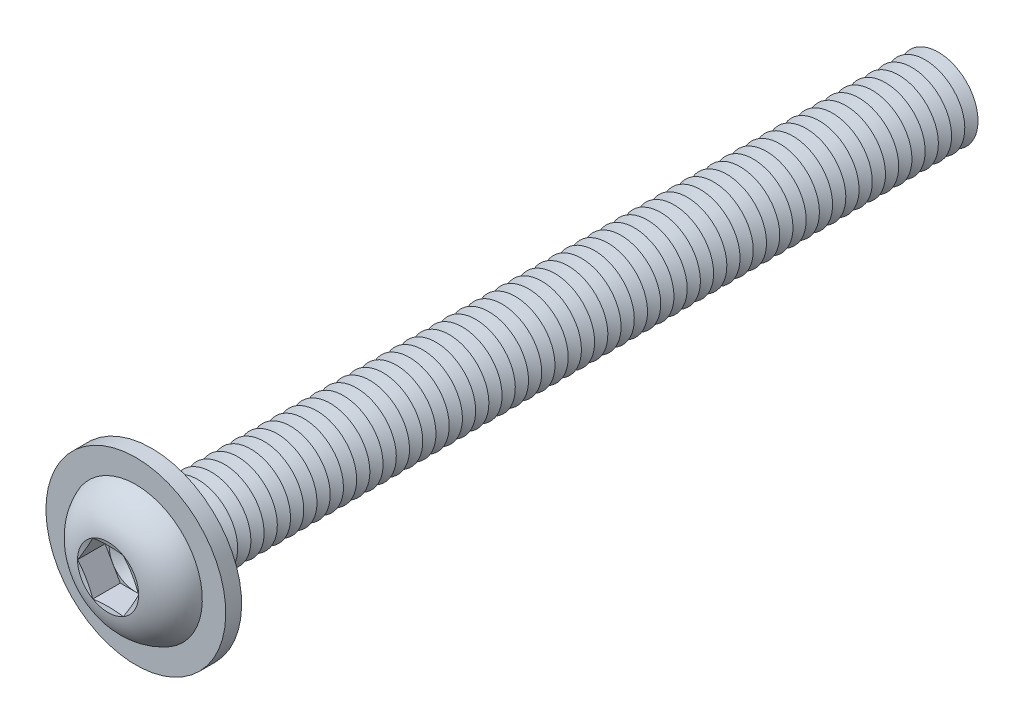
from build123d import *

# Parameters (mm, degrees)
FILLET1_R           = 0.5
LPATTERN1_COUNT     = 60
LPATTERN1_PITCH     = 1
CUT_EXTRUDE1_DEPTH  = 2.08
SKETCH5_R           = 6.8
SKETCH5_R_2         = 3.5
BOSS_EXTRUDE1_DEPTH = 1.2


with BuildPart() as part:
    # Sketch1 → Revolve1 (revolve)
    with BuildSketch(Plane(origin=(0, 0, 0), x_dir=(0, 0, -1), z_dir=(1, 0, 0))):
        with BuildLine():
            Line((0, 3), (0, 5.25))
            ThreePointArc((0, 5.25), (-2.210041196, 4.408189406), (-3.3, 2.3094))
            Line((-3.3, 2.3094), (-2.990599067, 1.1547))
            Line((-2.990599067, 1.1547), (-3.3, 1.1547))
            Line((-3.3, 1.1547), (-3.3, 0))
            Line((-3.3, 0), (60, 0))
            Line((60, 0), (60, 3))
            Line((60, 3), (0, 3))
        make_face()
    revolve(axis=Axis((0, 0, -60), (0, 0, 1)))

    # Fillet1
    fillet1_edges = [part.edges().sort_by_distance(p)[0] for p in [
        (0, -3, 0),
    ]]
    fillet(fillet1_edges, radius=FILLET1_R)

    # Sketch2 → Cut-Revolve1 (revolve, cut)
    with BuildSketch(Plane(origin=(0, 0, 0), x_dir=(0, 0, -1), z_dir=(1, 0, 0))):
        Polygon((59.5, 3), (60.5, 3), (60, 2.133974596), align=None)
    cut_revolve1 = revolve(axis=Axis((0, 0, -60), (0, 0, -1)), mode=Mode.SUBTRACT)

    # LPattern1: Cut-Revolve1 ×60
    with Locations(*[(0, 0, i * LPATTERN1_PITCH) for i in range(1, LPATTERN1_COUNT)]):
        add(cut_revolve1, mode=Mode.SUBTRACT)

    # Sketch3 → Cut-Extrude1 (cut)
    with BuildSketch(Plane.XY.offset(3.3)):
        Polygon((1.1547, 1.999999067), (-1.1547, 1.999999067), (-2.3094, 0), (-1.1547, -1.999999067), (1.1547, -1.999999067), (2.3094, 0), align=None)
    extrude(amount=-CUT_EXTRUDE1_DEPTH, mode=Mode.SUBTRACT)

    # Cut-Extrude2 cone 1 section (on through the dimple's axis) → Cut-Extrude2 (revolve, cut)
    with BuildSketch(Plane(origin=(0, 0, 1.22), x_dir=(0, -1, 0), z_dir=(1, 0, 0))):
        Polygon((0, 0), (1.999999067, 0), (0, 1.1547), align=None)
    revolve(axis=Axis((0, 0, 1.22), (0, 0, -1)), mode=Mode.SUBTRACT)

    # Sketch5 → Boss-Extrude1 (add)
    with BuildSketch(Plane(origin=(0, 0, 0), x_dir=(-1, 0, 0), z_dir=(0, 0, -1))):
        with Locations(Location((0, 0, 0), (0, 0, 90))):
            Circle(SKETCH5_R)
        Circle(SKETCH5_R_2, mode=Mode.SUBTRACT)
    extrude(amount=-BOSS_EXTRUDE1_DEPTH)


solid = part.part
